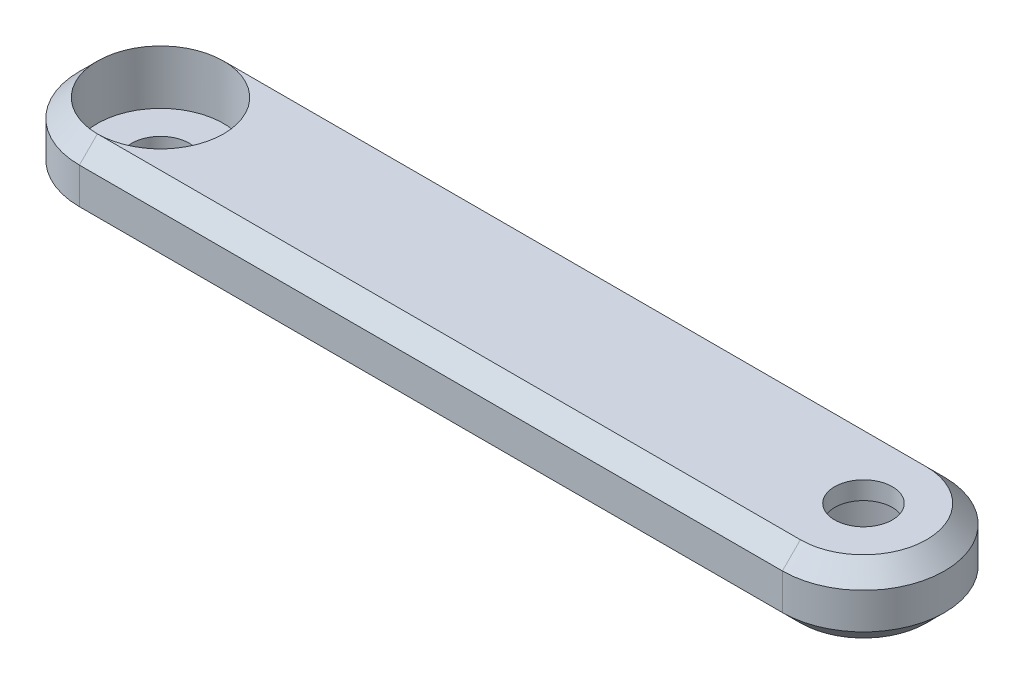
ISO-10303-21;
HEADER;
FILE_DESCRIPTION(('STEP AP214'),'2;1');
FILE_NAME('part.step','',(''),(''),'','','');
FILE_SCHEMA(('AUTOMOTIVE_DESIGN { 1 0 10303 214 1 1 1 1 }'));
ENDSEC;
DATA;
#1=APPLICATION_CONTEXT('core data for automotive mechanical design processes');
#2=APPLICATION_PROTOCOL_DEFINITION('international standard','automotive_design',2000,#1);
#3=PRODUCT_CONTEXT('',#1,'mechanical');
#4=PRODUCT('Part','Part','',(#3));
#5=PRODUCT_RELATED_PRODUCT_CATEGORY('part','',(#4));
#6=PRODUCT_DEFINITION_FORMATION('','',#4);
#7=PRODUCT_DEFINITION_CONTEXT('part definition',#1,'design');
#8=PRODUCT_DEFINITION('design','',#6,#7);
#9=PRODUCT_DEFINITION_SHAPE('','',#8);
#10=(LENGTH_UNIT() NAMED_UNIT(*) SI_UNIT(.MILLI.,.METRE.));
#11=(NAMED_UNIT(*) PLANE_ANGLE_UNIT() SI_UNIT($,.RADIAN.));
#12=(NAMED_UNIT(*) SI_UNIT($,.STERADIAN.) SOLID_ANGLE_UNIT());
#13=UNCERTAINTY_MEASURE_WITH_UNIT(LENGTH_MEASURE(1.E-05),#10,'distance_accuracy_value','');
#14=(GEOMETRIC_REPRESENTATION_CONTEXT(3) GLOBAL_UNCERTAINTY_ASSIGNED_CONTEXT((#13)) GLOBAL_UNIT_ASSIGNED_CONTEXT((#10,
#11,#12)) REPRESENTATION_CONTEXT('',''));
#15=CARTESIAN_POINT('',(0.,0.,0.));
#16=DIRECTION('',(0.,0.,1.));
#17=DIRECTION('',(1.,0.,0.));
#18=AXIS2_PLACEMENT_3D('',#15,#16,#17);
#19=CARTESIAN_POINT('',(-15.6632860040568,-6.,-1.3052738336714));
#20=DIRECTION('',(0.,1.,0.));
#21=DIRECTION('',(0.,0.,1.));
#22=AXIS2_PLACEMENT_3D('',#19,#20,#21);
#23=CYLINDRICAL_SURFACE('',#22,1.6);
#24=CARTESIAN_POINT('',(-15.6632860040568,0.,-1.3052738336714));
#25=DIRECTION('',(0.,1.,0.));
#26=DIRECTION('',(0.,0.,1.));
#27=AXIS2_PLACEMENT_3D('',#24,#25,#26);
#28=CIRCLE('',#27,1.6);
#29=CARTESIAN_POINT('',(-15.6632860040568,0.,0.294726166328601));
#30=VERTEX_POINT('',#29);
#31=EDGE_CURVE('E196',#30,#30,#28,.T.);
#32=ORIENTED_EDGE('',*,*,#31,.F.);
#33=EDGE_LOOP('',(#32));
#34=FACE_BOUND('',#33,.T.);
#35=CARTESIAN_POINT('',(-15.6632860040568,1.,-1.3052738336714));
#36=DIRECTION('',(0.,1.,0.));
#37=DIRECTION('',(0.,0.,1.));
#38=AXIS2_PLACEMENT_3D('',#35,#36,#37);
#39=CIRCLE('',#38,1.6);
#40=CARTESIAN_POINT('',(-15.6632860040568,1.,0.294726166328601));
#41=VERTEX_POINT('',#40);
#42=EDGE_CURVE('E46',#41,#41,#39,.F.);
#43=ORIENTED_EDGE('',*,*,#42,.F.);
#44=EDGE_LOOP('',(#43));
#45=FACE_BOUND('',#44,.T.);
#46=ADVANCED_FACE('F41',(#34,#45),#23,.F.);
#47=CARTESIAN_POINT('',(23.3367139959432,-6.,-1.3052738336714));
#48=DIRECTION('',(0.,1.,0.));
#49=DIRECTION('',(0.,0.,1.));
#50=AXIS2_PLACEMENT_3D('',#47,#48,#49);
#51=CYLINDRICAL_SURFACE('',#50,1.6);
#52=CARTESIAN_POINT('',(23.3367139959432,4.,-1.3052738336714));
#53=DIRECTION('',(0.,-1.,0.));
#54=DIRECTION('',(0.,0.,-1.));
#55=AXIS2_PLACEMENT_3D('',#52,#53,#54);
#56=CIRCLE('',#55,1.6);
#57=CARTESIAN_POINT('',(23.3367139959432,4.,-2.9052738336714));
#58=VERTEX_POINT('',#57);
#59=EDGE_CURVE('E135',#58,#58,#56,.T.);
#60=ORIENTED_EDGE('',*,*,#59,.F.);
#61=EDGE_LOOP('',(#60));
#62=FACE_BOUND('',#61,.T.);
#63=CARTESIAN_POINT('',(23.3367139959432,3.,-1.3052738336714));
#64=DIRECTION('',(0.,-1.,0.));
#65=DIRECTION('',(0.,0.,-1.));
#66=AXIS2_PLACEMENT_3D('',#63,#64,#65);
#67=CIRCLE('',#66,1.6);
#68=CARTESIAN_POINT('',(23.3367139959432,3.,-2.9052738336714));
#69=VERTEX_POINT('',#68);
#70=EDGE_CURVE('E176',#69,#69,#67,.T.);
#71=ORIENTED_EDGE('',*,*,#70,.T.);
#72=EDGE_LOOP('',(#71));
#73=FACE_BOUND('',#72,.T.);
#74=ADVANCED_FACE('F215',(#62,#73),#51,.F.);
#75=CARTESIAN_POINT('',(-15.6632860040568,4.,-1.3052738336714));
#76=DIRECTION('',(0.,1.,0.));
#77=DIRECTION('',(0.,0.,1.));
#78=AXIS2_PLACEMENT_3D('',#75,#76,#77);
#79=PLANE('',#78);
#80=CARTESIAN_POINT('',(-15.6632860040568,4.,-1.3052738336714));
#81=DIRECTION('',(0.,1.,0.));
#82=DIRECTION('',(0.,0.,1.));
#83=AXIS2_PLACEMENT_3D('',#80,#81,#82);
#84=CIRCLE('',#83,3.5);
#85=CARTESIAN_POINT('',(-15.6632860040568,4.,2.19472616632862));
#86=VERTEX_POINT('',#85);
#87=CARTESIAN_POINT('',(-15.6632860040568,4.,-4.80527383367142));
#88=VERTEX_POINT('',#87);
#89=EDGE_CURVE('E109',#86,#88,#84,.T.);
#90=ORIENTED_EDGE('',*,*,#89,.F.);
#91=DIRECTION('',(1.,0.,0.));
#92=VECTOR('',#91,1.);
#93=CARTESIAN_POINT('',(23.3367139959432,4.,2.19472616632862));
#94=LINE('',#93,#92);
#95=CARTESIAN_POINT('',(23.3367139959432,4.,2.19472616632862));
#96=VERTEX_POINT('',#95);
#97=EDGE_CURVE('E123',#86,#96,#94,.T.);
#98=ORIENTED_EDGE('',*,*,#97,.T.);
#99=CARTESIAN_POINT('',(23.3367139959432,4.,-1.3052738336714));
#100=DIRECTION('',(0.,1.,0.));
#101=DIRECTION('',(0.,0.,1.));
#102=AXIS2_PLACEMENT_3D('',#99,#100,#101);
#103=CIRCLE('',#102,3.50000000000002);
#104=CARTESIAN_POINT('',(23.3367139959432,4.,-4.80527383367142));
#105=VERTEX_POINT('',#104);
#106=EDGE_CURVE('E141',#96,#105,#103,.T.);
#107=ORIENTED_EDGE('',*,*,#106,.T.);
#108=DIRECTION('',(-1.,0.,0.));
#109=VECTOR('',#108,1.);
#110=CARTESIAN_POINT('',(-15.6632860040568,4.,-4.80527383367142));
#111=LINE('',#110,#109);
#112=EDGE_CURVE('E115',#105,#88,#111,.T.);
#113=ORIENTED_EDGE('',*,*,#112,.T.);
#114=EDGE_LOOP('',(#90,#98,#107,#113));
#115=FACE_BOUND('',#114,.T.);
#116=ORIENTED_EDGE('',*,*,#59,.T.);
#117=EDGE_LOOP('',(#116));
#118=FACE_BOUND('',#117,.T.);
#119=ADVANCED_FACE('F119',(#115,#118),#79,.T.);
#120=CARTESIAN_POINT('',(-15.6632860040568,0.,-1.3052738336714));
#121=DIRECTION('',(0.,1.,0.));
#122=DIRECTION('',(0.,0.,1.));
#123=AXIS2_PLACEMENT_3D('',#120,#121,#122);
#124=PLANE('',#123);
#125=DIRECTION('',(1.,0.,0.));
#126=VECTOR('',#125,1.);
#127=CARTESIAN_POINT('',(-15.6632860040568,0.,-4.80527383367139));
#128=LINE('',#127,#126);
#129=CARTESIAN_POINT('',(-15.6632860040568,0.,-4.80527383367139));
#130=VERTEX_POINT('',#129);
#131=CARTESIAN_POINT('',(23.3367139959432,0.,-4.80527383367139));
#132=VERTEX_POINT('',#131);
#133=EDGE_CURVE('E163',#130,#132,#128,.T.);
#134=ORIENTED_EDGE('',*,*,#133,.T.);
#135=CARTESIAN_POINT('',(23.3367139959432,0.,-1.3052738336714));
#136=DIRECTION('',(0.,-1.,0.));
#137=DIRECTION('',(0.,0.,-1.));
#138=AXIS2_PLACEMENT_3D('',#135,#136,#137);
#139=CIRCLE('',#138,3.5);
#140=CARTESIAN_POINT('',(23.3367139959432,0.,2.1947261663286));
#141=VERTEX_POINT('',#140);
#142=EDGE_CURVE('E63',#141,#132,#139,.T.);
#143=ORIENTED_EDGE('',*,*,#142,.F.);
#144=DIRECTION('',(-1.,0.,0.));
#145=VECTOR('',#144,1.);
#146=CARTESIAN_POINT('',(-15.6632860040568,0.,2.19472616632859));
#147=LINE('',#146,#145);
#148=CARTESIAN_POINT('',(-15.6632860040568,0.,2.19472616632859));
#149=VERTEX_POINT('',#148);
#150=EDGE_CURVE('E51',#141,#149,#147,.T.);
#151=ORIENTED_EDGE('',*,*,#150,.T.);
#152=CARTESIAN_POINT('',(-15.6632860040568,0.,-1.3052738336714));
#153=DIRECTION('',(0.,1.,0.));
#154=DIRECTION('',(0.,0.,1.));
#155=AXIS2_PLACEMENT_3D('',#152,#153,#154);
#156=CIRCLE('',#155,3.49999999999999);
#157=EDGE_CURVE('E165',#149,#130,#156,.F.);
#158=ORIENTED_EDGE('',*,*,#157,.T.);
#159=EDGE_LOOP('',(#134,#143,#151,#158));
#160=FACE_BOUND('',#159,.T.);
#161=ORIENTED_EDGE('',*,*,#31,.T.);
#162=EDGE_LOOP('',(#161));
#163=FACE_BOUND('',#162,.T.);
#164=ADVANCED_FACE('F211',(#160,#163),#124,.F.);
#165=CARTESIAN_POINT('',(-15.6632860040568,4.,-1.3052738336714));
#166=DIRECTION('',(0.,-1.,0.));
#167=DIRECTION('',(0.,0.,-1.));
#168=AXIS2_PLACEMENT_3D('',#165,#166,#167);
#169=CYLINDRICAL_SURFACE('',#168,4.5);
#170=DIRECTION('',(0.,-1.,0.));
#171=VECTOR('',#170,1.);
#172=CARTESIAN_POINT('',(-15.6632860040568,4.,3.1947261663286));
#173=LINE('',#172,#171);
#174=CARTESIAN_POINT('',(-15.6632860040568,3.00000000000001,3.1947261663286));
#175=VERTEX_POINT('',#174);
#176=CARTESIAN_POINT('',(-15.6632860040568,1.,3.1947261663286));
#177=VERTEX_POINT('',#176);
#178=EDGE_CURVE('E116',#175,#177,#173,.T.);
#179=ORIENTED_EDGE('',*,*,#178,.F.);
#180=CARTESIAN_POINT('',(-15.6632860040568,3.00000000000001,-1.3052738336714));
#181=DIRECTION('',(0.,1.,0.));
#182=DIRECTION('',(0.,0.,1.));
#183=AXIS2_PLACEMENT_3D('',#180,#181,#182);
#184=CIRCLE('',#183,4.5);
#185=CARTESIAN_POINT('',(-15.6632860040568,3.00000000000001,-5.8052738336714));
#186=VERTEX_POINT('',#185);
#187=EDGE_CURVE('E132',#175,#186,#184,.F.);
#188=ORIENTED_EDGE('',*,*,#187,.T.);
#189=DIRECTION('',(0.,-1.,0.));
#190=VECTOR('',#189,1.);
#191=CARTESIAN_POINT('',(-15.6632860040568,4.,-5.8052738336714));
#192=LINE('',#191,#190);
#193=CARTESIAN_POINT('',(-15.6632860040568,1.,-5.8052738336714));
#194=VERTEX_POINT('',#193);
#195=EDGE_CURVE('E197',#186,#194,#192,.T.);
#196=ORIENTED_EDGE('',*,*,#195,.T.);
#197=CARTESIAN_POINT('',(-15.6632860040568,1.,-1.3052738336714));
#198=DIRECTION('',(0.,1.,0.));
#199=DIRECTION('',(0.,0.,1.));
#200=AXIS2_PLACEMENT_3D('',#197,#198,#199);
#201=CIRCLE('',#200,4.5);
#202=EDGE_CURVE('E160',#194,#177,#201,.T.);
#203=ORIENTED_EDGE('',*,*,#202,.T.);
#204=EDGE_LOOP('',(#179,#188,#196,#203));
#205=FACE_BOUND('',#204,.T.);
#206=ADVANCED_FACE('F248',(#205),#169,.T.);
#207=CARTESIAN_POINT('',(11.3367139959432,4.,3.1947261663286));
#208=DIRECTION('',(0.,0.,-1.));
#209=DIRECTION('',(-1.,0.,0.));
#210=AXIS2_PLACEMENT_3D('',#207,#208,#209);
#211=PLANE('',#210);
#212=DIRECTION('',(0.,-1.,0.));
#213=VECTOR('',#212,1.);
#214=CARTESIAN_POINT('',(23.3367139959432,4.,3.1947261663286));
#215=LINE('',#214,#213);
#216=CARTESIAN_POINT('',(23.3367139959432,3.00000000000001,3.1947261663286));
#217=VERTEX_POINT('',#216);
#218=CARTESIAN_POINT('',(23.3367139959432,1.,3.1947261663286));
#219=VERTEX_POINT('',#218);
#220=EDGE_CURVE('E203',#217,#219,#215,.T.);
#221=ORIENTED_EDGE('',*,*,#220,.F.);
#222=DIRECTION('',(-1.,0.,0.));
#223=VECTOR('',#222,1.);
#224=CARTESIAN_POINT('',(-15.6632860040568,3.00000000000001,3.1947261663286));
#225=LINE('',#224,#223);
#226=EDGE_CURVE('E154',#217,#175,#225,.T.);
#227=ORIENTED_EDGE('',*,*,#226,.T.);
#228=ORIENTED_EDGE('',*,*,#178,.T.);
#229=DIRECTION('',(1.,0.,0.));
#230=VECTOR('',#229,1.);
#231=CARTESIAN_POINT('',(11.3367139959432,1.,3.1947261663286));
#232=LINE('',#231,#230);
#233=EDGE_CURVE('E152',#177,#219,#232,.T.);
#234=ORIENTED_EDGE('',*,*,#233,.T.);
#235=EDGE_LOOP('',(#221,#227,#228,#234));
#236=FACE_BOUND('',#235,.T.);
#237=ADVANCED_FACE('F256',(#236),#211,.F.);
#238=CARTESIAN_POINT('',(23.3367139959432,4.,-1.3052738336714));
#239=DIRECTION('',(0.,-1.,0.));
#240=DIRECTION('',(0.,0.,-1.));
#241=AXIS2_PLACEMENT_3D('',#238,#239,#240);
#242=CYLINDRICAL_SURFACE('',#241,4.5);
#243=DIRECTION('',(0.,-1.,0.));
#244=VECTOR('',#243,1.);
#245=CARTESIAN_POINT('',(23.3367139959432,4.,-5.8052738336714));
#246=LINE('',#245,#244);
#247=CARTESIAN_POINT('',(23.3367139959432,3.00000000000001,-5.8052738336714));
#248=VERTEX_POINT('',#247);
#249=CARTESIAN_POINT('',(23.3367139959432,1.,-5.8052738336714));
#250=VERTEX_POINT('',#249);
#251=EDGE_CURVE('E200',#248,#250,#246,.T.);
#252=ORIENTED_EDGE('',*,*,#251,.F.);
#253=CARTESIAN_POINT('',(23.3367139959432,3.00000000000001,-1.3052738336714));
#254=DIRECTION('',(0.,1.,0.));
#255=DIRECTION('',(0.,0.,1.));
#256=AXIS2_PLACEMENT_3D('',#253,#254,#255);
#257=CIRCLE('',#256,4.5);
#258=EDGE_CURVE('E149',#248,#217,#257,.F.);
#259=ORIENTED_EDGE('',*,*,#258,.T.);
#260=ORIENTED_EDGE('',*,*,#220,.T.);
#261=CARTESIAN_POINT('',(23.3367139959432,1.,-1.3052738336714));
#262=DIRECTION('',(0.,1.,0.));
#263=DIRECTION('',(0.,0.,1.));
#264=AXIS2_PLACEMENT_3D('',#261,#262,#263);
#265=CIRCLE('',#264,4.5);
#266=EDGE_CURVE('E143',#219,#250,#265,.T.);
#267=ORIENTED_EDGE('',*,*,#266,.T.);
#268=EDGE_LOOP('',(#252,#259,#260,#267));
#269=FACE_BOUND('',#268,.T.);
#270=ADVANCED_FACE('F252',(#269),#242,.T.);
#271=CARTESIAN_POINT('',(-15.6632860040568,4.,-5.8052738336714));
#272=DIRECTION('',(0.,0.,1.));
#273=DIRECTION('',(1.,0.,0.));
#274=AXIS2_PLACEMENT_3D('',#271,#272,#273);
#275=PLANE('',#274);
#276=ORIENTED_EDGE('',*,*,#195,.F.);
#277=DIRECTION('',(1.,0.,0.));
#278=VECTOR('',#277,1.);
#279=CARTESIAN_POINT('',(23.3367139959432,3.00000000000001,-5.8052738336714));
#280=LINE('',#279,#278);
#281=EDGE_CURVE('E158',#186,#248,#280,.T.);
#282=ORIENTED_EDGE('',*,*,#281,.T.);
#283=ORIENTED_EDGE('',*,*,#251,.T.);
#284=DIRECTION('',(-1.,0.,0.));
#285=VECTOR('',#284,1.);
#286=CARTESIAN_POINT('',(-15.6632860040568,1.,-5.8052738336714));
#287=LINE('',#286,#285);
#288=EDGE_CURVE('E156',#250,#194,#287,.T.);
#289=ORIENTED_EDGE('',*,*,#288,.T.);
#290=EDGE_LOOP('',(#276,#282,#283,#289));
#291=FACE_BOUND('',#290,.T.);
#292=ADVANCED_FACE('F249',(#291),#275,.F.);
#293=CARTESIAN_POINT('',(-15.6632860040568,4.,-1.3052738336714));
#294=DIRECTION('',(0.,-1.,0.));
#295=DIRECTION('',(0.,0.,-1.));
#296=AXIS2_PLACEMENT_3D('',#293,#294,#295);
#297=CONICAL_SURFACE('',#296,3.50000000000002,0.785398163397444);
#298=DIRECTION('',(0.,0.70710678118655,0.707106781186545));
#299=VECTOR('',#298,1.);
#300=CARTESIAN_POINT('',(-15.6632860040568,3.00000000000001,-5.8052738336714));
#301=LINE('',#300,#299);
#302=EDGE_CURVE('E136',#186,#88,#301,.T.);
#303=ORIENTED_EDGE('',*,*,#302,.F.);
#304=ORIENTED_EDGE('',*,*,#187,.F.);
#305=DIRECTION('',(0.,-0.70710678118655,0.707106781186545));
#306=VECTOR('',#305,1.);
#307=CARTESIAN_POINT('',(-15.6632860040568,4.,2.19472616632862));
#308=LINE('',#307,#306);
#309=EDGE_CURVE('E130',#86,#175,#308,.T.);
#310=ORIENTED_EDGE('',*,*,#309,.F.);
#311=CARTESIAN_POINT('',(-15.6632860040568,4.,-1.3052738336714));
#312=DIRECTION('',(0.,1.,0.));
#313=DIRECTION('',(0.,0.,1.));
#314=AXIS2_PLACEMENT_3D('',#311,#312,#313);
#315=CIRCLE('',#314,3.50000000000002);
#316=EDGE_CURVE('E106',#88,#86,#315,.T.);
#317=ORIENTED_EDGE('',*,*,#316,.F.);
#318=EDGE_LOOP('',(#303,#304,#310,#317));
#319=FACE_BOUND('',#318,.T.);
#320=ADVANCED_FACE('F131',(#319),#297,.T.);
#321=CARTESIAN_POINT('',(-15.6632860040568,4.,2.19472616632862));
#322=DIRECTION('',(0.,0.707106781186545,0.70710678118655));
#323=DIRECTION('',(-1.,0.,0.));
#324=AXIS2_PLACEMENT_3D('',#321,#322,#323);
#325=PLANE('',#324);
#326=ORIENTED_EDGE('',*,*,#309,.T.);
#327=ORIENTED_EDGE('',*,*,#226,.F.);
#328=DIRECTION('',(0.,-0.70710678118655,0.707106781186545));
#329=VECTOR('',#328,1.);
#330=CARTESIAN_POINT('',(23.3367139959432,4.,2.19472616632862));
#331=LINE('',#330,#329);
#332=EDGE_CURVE('E139',#96,#217,#331,.T.);
#333=ORIENTED_EDGE('',*,*,#332,.F.);
#334=ORIENTED_EDGE('',*,*,#97,.F.);
#335=EDGE_LOOP('',(#326,#327,#333,#334));
#336=FACE_BOUND('',#335,.T.);
#337=ADVANCED_FACE('F138',(#336),#325,.T.);
#338=CARTESIAN_POINT('',(-15.6632860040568,4.,-4.80527383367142));
#339=DIRECTION('',(0.,0.707106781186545,-0.70710678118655));
#340=DIRECTION('',(1.,0.,0.));
#341=AXIS2_PLACEMENT_3D('',#338,#339,#340);
#342=PLANE('',#341);
#343=ORIENTED_EDGE('',*,*,#302,.T.);
#344=ORIENTED_EDGE('',*,*,#112,.F.);
#345=DIRECTION('',(0.,0.70710678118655,0.707106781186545));
#346=VECTOR('',#345,1.);
#347=CARTESIAN_POINT('',(23.3367139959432,3.00000000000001,-5.8052738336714));
#348=LINE('',#347,#346);
#349=EDGE_CURVE('E168',#248,#105,#348,.T.);
#350=ORIENTED_EDGE('',*,*,#349,.F.);
#351=ORIENTED_EDGE('',*,*,#281,.F.);
#352=EDGE_LOOP('',(#343,#344,#350,#351));
#353=FACE_BOUND('',#352,.T.);
#354=ADVANCED_FACE('F271',(#353),#342,.T.);
#355=CARTESIAN_POINT('',(23.3367139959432,4.,-1.3052738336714));
#356=DIRECTION('',(0.,-1.,0.));
#357=DIRECTION('',(0.,0.,-1.));
#358=AXIS2_PLACEMENT_3D('',#355,#356,#357);
#359=CONICAL_SURFACE('',#358,3.50000000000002,0.785398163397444);
#360=ORIENTED_EDGE('',*,*,#332,.T.);
#361=ORIENTED_EDGE('',*,*,#258,.F.);
#362=ORIENTED_EDGE('',*,*,#349,.T.);
#363=ORIENTED_EDGE('',*,*,#106,.F.);
#364=EDGE_LOOP('',(#360,#361,#362,#363));
#365=FACE_BOUND('',#364,.T.);
#366=ADVANCED_FACE('F265',(#365),#359,.T.);
#367=CARTESIAN_POINT('',(-15.6632860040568,1.,-1.3052738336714));
#368=DIRECTION('',(0.,1.,0.));
#369=DIRECTION('',(0.,0.,1.));
#370=AXIS2_PLACEMENT_3D('',#367,#368,#369);
#371=CONICAL_SURFACE('',#370,4.5,0.785398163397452);
#372=DIRECTION('',(0.,0.707106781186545,-0.70710678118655));
#373=VECTOR('',#372,1.);
#374=CARTESIAN_POINT('',(-15.6632860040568,0.,-4.80527383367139));
#375=LINE('',#374,#373);
#376=EDGE_CURVE('E179',#130,#194,#375,.T.);
#377=ORIENTED_EDGE('',*,*,#376,.F.);
#378=ORIENTED_EDGE('',*,*,#157,.F.);
#379=DIRECTION('',(0.,-0.707106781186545,-0.70710678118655));
#380=VECTOR('',#379,1.);
#381=CARTESIAN_POINT('',(-15.6632860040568,1.,3.1947261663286));
#382=LINE('',#381,#380);
#383=EDGE_CURVE('E170',#177,#149,#382,.T.);
#384=ORIENTED_EDGE('',*,*,#383,.F.);
#385=ORIENTED_EDGE('',*,*,#202,.F.);
#386=EDGE_LOOP('',(#377,#378,#384,#385));
#387=FACE_BOUND('',#386,.T.);
#388=ADVANCED_FACE('F44',(#387),#371,.T.);
#389=CARTESIAN_POINT('',(11.3367139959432,1.,3.1947261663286));
#390=DIRECTION('',(0.,0.70710678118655,-0.707106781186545));
#391=DIRECTION('',(1.,0.,0.));
#392=AXIS2_PLACEMENT_3D('',#389,#390,#391);
#393=PLANE('',#392);
#394=ORIENTED_EDGE('',*,*,#383,.T.);
#395=ORIENTED_EDGE('',*,*,#150,.F.);
#396=DIRECTION('',(0.,-0.707106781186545,-0.70710678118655));
#397=VECTOR('',#396,1.);
#398=CARTESIAN_POINT('',(23.3367139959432,1.,3.1947261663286));
#399=LINE('',#398,#397);
#400=EDGE_CURVE('E175',#219,#141,#399,.T.);
#401=ORIENTED_EDGE('',*,*,#400,.F.);
#402=ORIENTED_EDGE('',*,*,#233,.F.);
#403=EDGE_LOOP('',(#394,#395,#401,#402));
#404=FACE_BOUND('',#403,.T.);
#405=ADVANCED_FACE('F300',(#404),#393,.F.);
#406=CARTESIAN_POINT('',(-15.6632860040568,1.,-5.8052738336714));
#407=DIRECTION('',(0.,0.70710678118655,0.707106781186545));
#408=DIRECTION('',(-1.,0.,0.));
#409=AXIS2_PLACEMENT_3D('',#406,#407,#408);
#410=PLANE('',#409);
#411=ORIENTED_EDGE('',*,*,#376,.T.);
#412=ORIENTED_EDGE('',*,*,#288,.F.);
#413=DIRECTION('',(0.,0.707106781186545,-0.70710678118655));
#414=VECTOR('',#413,1.);
#415=CARTESIAN_POINT('',(23.3367139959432,0.,-4.80527383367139));
#416=LINE('',#415,#414);
#417=EDGE_CURVE('E173',#132,#250,#416,.T.);
#418=ORIENTED_EDGE('',*,*,#417,.F.);
#419=ORIENTED_EDGE('',*,*,#133,.F.);
#420=EDGE_LOOP('',(#411,#412,#418,#419));
#421=FACE_BOUND('',#420,.T.);
#422=ADVANCED_FACE('F294',(#421),#410,.F.);
#423=CARTESIAN_POINT('',(23.3367139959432,1.,-1.3052738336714));
#424=DIRECTION('',(0.,1.,0.));
#425=DIRECTION('',(0.,0.,1.));
#426=AXIS2_PLACEMENT_3D('',#423,#424,#425);
#427=CONICAL_SURFACE('',#426,4.5,0.785398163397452);
#428=ORIENTED_EDGE('',*,*,#400,.T.);
#429=CARTESIAN_POINT('',(23.3367139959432,0.,-1.3052738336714));
#430=DIRECTION('',(0.,1.,0.));
#431=DIRECTION('',(0.,0.,1.));
#432=AXIS2_PLACEMENT_3D('',#429,#430,#431);
#433=CIRCLE('',#432,3.49999999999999);
#434=EDGE_CURVE('E11',#132,#141,#433,.F.);
#435=ORIENTED_EDGE('',*,*,#434,.F.);
#436=ORIENTED_EDGE('',*,*,#417,.T.);
#437=ORIENTED_EDGE('',*,*,#266,.F.);
#438=EDGE_LOOP('',(#428,#435,#436,#437));
#439=FACE_BOUND('',#438,.T.);
#440=ADVANCED_FACE('F239',(#439),#427,.T.);
#441=CARTESIAN_POINT('',(23.3367139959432,3.,-1.3052738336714));
#442=DIRECTION('',(0.,-1.,0.));
#443=DIRECTION('',(0.,0.,-1.));
#444=AXIS2_PLACEMENT_3D('',#441,#442,#443);
#445=CYLINDRICAL_SURFACE('',#444,3.5);
#446=CARTESIAN_POINT('',(23.3367139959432,3.,-1.3052738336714));
#447=DIRECTION('',(0.,-1.,0.));
#448=DIRECTION('',(0.,0.,-1.));
#449=AXIS2_PLACEMENT_3D('',#446,#447,#448);
#450=CIRCLE('',#449,3.5);
#451=CARTESIAN_POINT('',(23.3367139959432,3.,-4.8052738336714));
#452=VERTEX_POINT('',#451);
#453=EDGE_CURVE('E184',#452,#452,#450,.T.);
#454=ORIENTED_EDGE('',*,*,#453,.F.);
#455=EDGE_LOOP('',(#454));
#456=FACE_BOUND('',#455,.T.);
#457=ORIENTED_EDGE('',*,*,#434,.T.);
#458=ORIENTED_EDGE('',*,*,#142,.T.);
#459=EDGE_LOOP('',(#457,#458));
#460=FACE_BOUND('',#459,.T.);
#461=ADVANCED_FACE('F235',(#456,#460),#445,.F.);
#462=CARTESIAN_POINT('',(23.3367139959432,3.,-1.3052738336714));
#463=DIRECTION('',(0.,-1.,0.));
#464=DIRECTION('',(0.,0.,-1.));
#465=AXIS2_PLACEMENT_3D('',#462,#463,#464);
#466=PLANE('',#465);
#467=ORIENTED_EDGE('',*,*,#70,.F.);
#468=EDGE_LOOP('',(#467));
#469=FACE_BOUND('',#468,.T.);
#470=ORIENTED_EDGE('',*,*,#453,.T.);
#471=EDGE_LOOP('',(#470));
#472=FACE_BOUND('',#471,.T.);
#473=ADVANCED_FACE('F230',(#469,#472),#466,.T.);
#474=CARTESIAN_POINT('',(-15.6632860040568,1.,-1.3052738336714));
#475=DIRECTION('',(0.,1.,0.));
#476=DIRECTION('',(0.,0.,1.));
#477=AXIS2_PLACEMENT_3D('',#474,#475,#476);
#478=PLANE('',#477);
#479=CARTESIAN_POINT('',(-15.6632860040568,1.,-1.3052738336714));
#480=DIRECTION('',(0.,1.,0.));
#481=DIRECTION('',(0.,0.,1.));
#482=AXIS2_PLACEMENT_3D('',#479,#480,#481);
#483=CIRCLE('',#482,3.5);
#484=CARTESIAN_POINT('',(-15.6632860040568,1.,2.1947261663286));
#485=VERTEX_POINT('',#484);
#486=EDGE_CURVE('E126',#485,#485,#483,.T.);
#487=ORIENTED_EDGE('',*,*,#486,.T.);
#488=EDGE_LOOP('',(#487));
#489=FACE_BOUND('',#488,.T.);
#490=ORIENTED_EDGE('',*,*,#42,.T.);
#491=EDGE_LOOP('',(#490));
#492=FACE_BOUND('',#491,.T.);
#493=ADVANCED_FACE('F223',(#489,#492),#478,.T.);
#494=CARTESIAN_POINT('',(-15.6632860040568,1.,-1.3052738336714));
#495=DIRECTION('',(0.,1.,0.));
#496=DIRECTION('',(0.,0.,1.));
#497=AXIS2_PLACEMENT_3D('',#494,#495,#496);
#498=CYLINDRICAL_SURFACE('',#497,3.5);
#499=ORIENTED_EDGE('',*,*,#486,.F.);
#500=EDGE_LOOP('',(#499));
#501=FACE_BOUND('',#500,.T.);
#502=ORIENTED_EDGE('',*,*,#89,.T.);
#503=ORIENTED_EDGE('',*,*,#316,.T.);
#504=EDGE_LOOP('',(#502,#503));
#505=FACE_BOUND('',#504,.T.);
#506=ADVANCED_FACE('F108',(#501,#505),#498,.F.);
#507=CLOSED_SHELL('',(#46,#74,#119,#164,#206,#237,#270,#292,#320,#337,#354,#366,#388,#405,#422,
#440,#461,#473,#493,#506));
#508=MANIFOLD_SOLID_BREP('B2',#507);
#509=ADVANCED_BREP_SHAPE_REPRESENTATION('',(#18,#508),#14);
#510=SHAPE_DEFINITION_REPRESENTATION(#9,#509);
ENDSEC;
END-ISO-10303-21;
